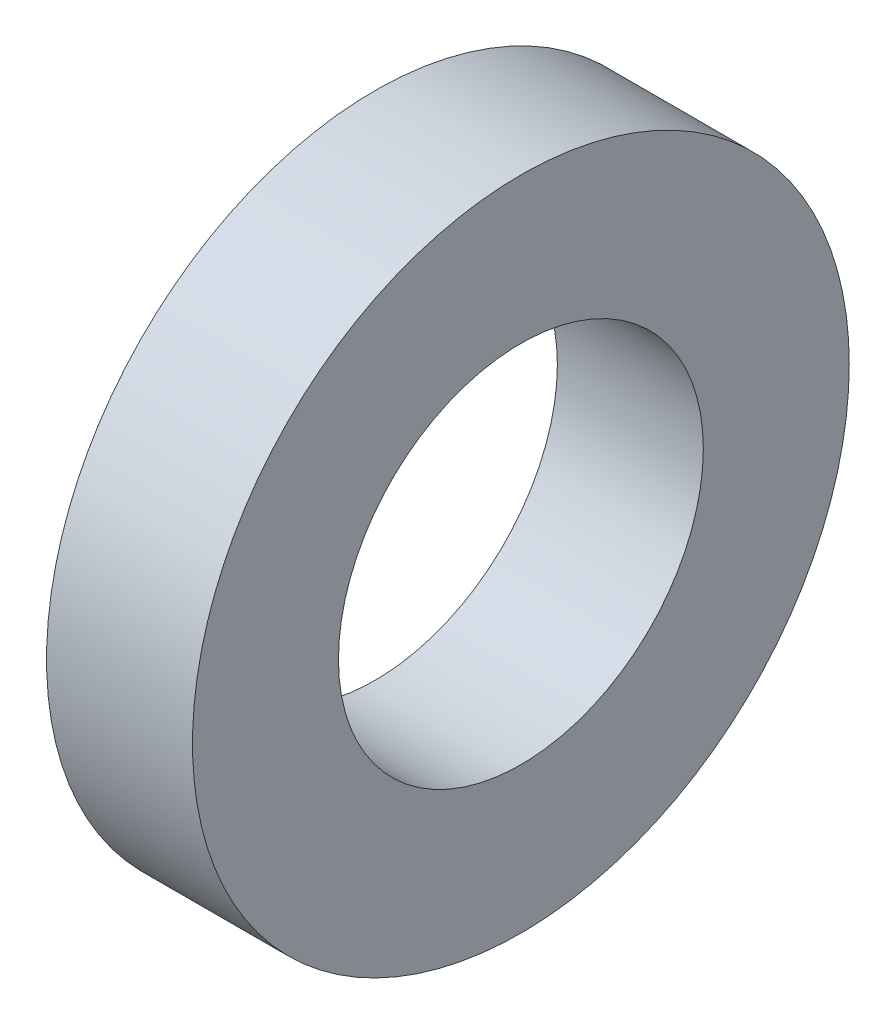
ISO-10303-21;
HEADER;
FILE_DESCRIPTION(('STEP AP214'),'2;1');
FILE_NAME('part.step','',(''),(''),'','','');
FILE_SCHEMA(('AUTOMOTIVE_DESIGN { 1 0 10303 214 1 1 1 1 }'));
ENDSEC;
DATA;
#1=APPLICATION_CONTEXT('core data for automotive mechanical design processes');
#2=APPLICATION_PROTOCOL_DEFINITION('international standard','automotive_design',2000,#1);
#3=PRODUCT_CONTEXT('',#1,'mechanical');
#4=PRODUCT('Part','Part','',(#3));
#5=PRODUCT_RELATED_PRODUCT_CATEGORY('part','',(#4));
#6=PRODUCT_DEFINITION_FORMATION('','',#4);
#7=PRODUCT_DEFINITION_CONTEXT('part definition',#1,'design');
#8=PRODUCT_DEFINITION('design','',#6,#7);
#9=PRODUCT_DEFINITION_SHAPE('','',#8);
#10=(LENGTH_UNIT() NAMED_UNIT(*) SI_UNIT(.MILLI.,.METRE.));
#11=(NAMED_UNIT(*) PLANE_ANGLE_UNIT() SI_UNIT($,.RADIAN.));
#12=(NAMED_UNIT(*) SI_UNIT($,.STERADIAN.) SOLID_ANGLE_UNIT());
#13=UNCERTAINTY_MEASURE_WITH_UNIT(LENGTH_MEASURE(1.E-05),#10,'distance_accuracy_value','');
#14=(GEOMETRIC_REPRESENTATION_CONTEXT(3) GLOBAL_UNCERTAINTY_ASSIGNED_CONTEXT((#13)) GLOBAL_UNIT_ASSIGNED_CONTEXT((#10,
#11,#12)) REPRESENTATION_CONTEXT('',''));
#15=CARTESIAN_POINT('',(0.,0.,0.));
#16=DIRECTION('',(0.,0.,1.));
#17=DIRECTION('',(1.,0.,0.));
#18=AXIS2_PLACEMENT_3D('',#15,#16,#17);
#19=CARTESIAN_POINT('',(4.,0.,0.));
#20=DIRECTION('',(1.,0.,0.));
#21=DIRECTION('',(0.,0.,-1.));
#22=AXIS2_PLACEMENT_3D('',#19,#20,#21);
#23=PLANE('',#22);
#24=CARTESIAN_POINT('',(4.,0.,0.));
#25=DIRECTION('',(1.,0.,0.));
#26=DIRECTION('',(0.,0.,-1.));
#27=AXIS2_PLACEMENT_3D('',#24,#25,#26);
#28=CIRCLE('',#27,9.);
#29=CARTESIAN_POINT('',(4.,0.,-9.));
#30=VERTEX_POINT('',#29);
#31=EDGE_CURVE('E10',#30,#30,#28,.T.);
#32=ORIENTED_EDGE('',*,*,#31,.T.);
#33=EDGE_LOOP('',(#32));
#34=FACE_BOUND('',#33,.T.);
#35=CARTESIAN_POINT('',(4.,0.,0.));
#36=DIRECTION('',(1.,0.,0.));
#37=DIRECTION('',(0.,0.,-1.));
#38=AXIS2_PLACEMENT_3D('',#35,#36,#37);
#39=CIRCLE('',#38,5.);
#40=CARTESIAN_POINT('',(4.,0.,-5.));
#41=VERTEX_POINT('',#40);
#42=EDGE_CURVE('E33',#41,#41,#39,.T.);
#43=ORIENTED_EDGE('',*,*,#42,.F.);
#44=EDGE_LOOP('',(#43));
#45=FACE_BOUND('',#44,.T.);
#46=ADVANCED_FACE('F22',(#34,#45),#23,.T.);
#47=CARTESIAN_POINT('',(0.,0.,0.));
#48=DIRECTION('',(1.,0.,0.));
#49=DIRECTION('',(0.,0.,-1.));
#50=AXIS2_PLACEMENT_3D('',#47,#48,#49);
#51=PLANE('',#50);
#52=CARTESIAN_POINT('',(0.,0.,0.));
#53=DIRECTION('',(1.,0.,0.));
#54=DIRECTION('',(0.,0.,-1.));
#55=AXIS2_PLACEMENT_3D('',#52,#53,#54);
#56=CIRCLE('',#55,9.);
#57=CARTESIAN_POINT('',(0.,0.,-9.));
#58=VERTEX_POINT('',#57);
#59=EDGE_CURVE('E29',#58,#58,#56,.T.);
#60=ORIENTED_EDGE('',*,*,#59,.F.);
#61=EDGE_LOOP('',(#60));
#62=FACE_BOUND('',#61,.T.);
#63=CARTESIAN_POINT('',(0.,0.,0.));
#64=DIRECTION('',(1.,0.,0.));
#65=DIRECTION('',(0.,0.,-1.));
#66=AXIS2_PLACEMENT_3D('',#63,#64,#65);
#67=CIRCLE('',#66,5.);
#68=CARTESIAN_POINT('',(0.,0.,-5.));
#69=VERTEX_POINT('',#68);
#70=EDGE_CURVE('E37',#69,#69,#67,.T.);
#71=ORIENTED_EDGE('',*,*,#70,.T.);
#72=EDGE_LOOP('',(#71));
#73=FACE_BOUND('',#72,.T.);
#74=ADVANCED_FACE('F43',(#62,#73),#51,.F.);
#75=CARTESIAN_POINT('',(4.,0.,0.));
#76=DIRECTION('',(-1.,0.,0.));
#77=DIRECTION('',(0.,0.,1.));
#78=AXIS2_PLACEMENT_3D('',#75,#76,#77);
#79=CYLINDRICAL_SURFACE('',#78,9.);
#80=ORIENTED_EDGE('',*,*,#31,.F.);
#81=EDGE_LOOP('',(#80));
#82=FACE_BOUND('',#81,.T.);
#83=ORIENTED_EDGE('',*,*,#59,.T.);
#84=EDGE_LOOP('',(#83));
#85=FACE_BOUND('',#84,.T.);
#86=ADVANCED_FACE('F24',(#82,#85),#79,.T.);
#87=CARTESIAN_POINT('',(4.,0.,0.));
#88=DIRECTION('',(-1.,0.,0.));
#89=DIRECTION('',(0.,0.,1.));
#90=AXIS2_PLACEMENT_3D('',#87,#88,#89);
#91=CYLINDRICAL_SURFACE('',#90,5.);
#92=ORIENTED_EDGE('',*,*,#42,.T.);
#93=EDGE_LOOP('',(#92));
#94=FACE_BOUND('',#93,.T.);
#95=ORIENTED_EDGE('',*,*,#70,.F.);
#96=EDGE_LOOP('',(#95));
#97=FACE_BOUND('',#96,.T.);
#98=ADVANCED_FACE('F45',(#94,#97),#91,.F.);
#99=CLOSED_SHELL('',(#46,#74,#86,#98));
#100=MANIFOLD_SOLID_BREP('B2',#99);
#101=ADVANCED_BREP_SHAPE_REPRESENTATION('',(#18,#100),#14);
#102=SHAPE_DEFINITION_REPRESENTATION(#9,#101);
ENDSEC;
END-ISO-10303-21;
